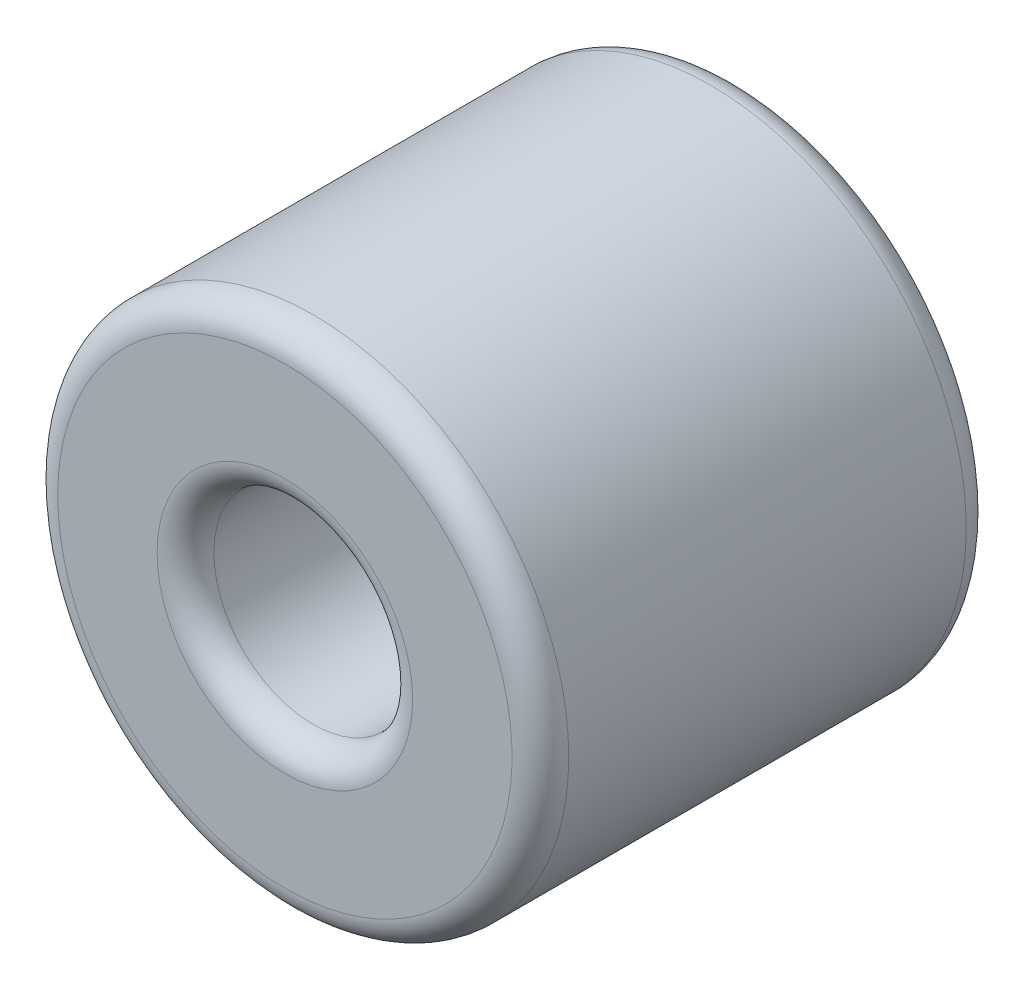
from build123d import *

# Parameters (mm, degrees)
SKETCH_1_W = 8
SKETCH_1_H = 2.75
FILLET_1_R = 0.5


with BuildPart() as part:
    # Sketch 1 → Revolve 1 (revolve)
    with BuildSketch(Plane(origin=(0, 0, 0), x_dir=(0, 0, -1), z_dir=(1, 0, 0)), mode=Mode.PRIVATE) as revolve_1_sk:
        with Locations((0, 3.125)):
            Rectangle(SKETCH_1_W, SKETCH_1_H)
    revolve(revolve_1_sk.sketch.rotate(Axis((0, 0, 4), (0, 0, -1)), 90), axis=Axis((0, 0, 4), (0, 0, -1)))

    # Fillet 1
    fillet_1_edges = [part.edges().sort_by_distance(p)[0] for p in [
        (-4.5, 0, 4),
        (-4.5, 0, -4),
        (-1.75, 0, -4),
        (-1.75, 0, 4),
    ]]
    fillet(fillet_1_edges, radius=FILLET_1_R)


solid = part.part
